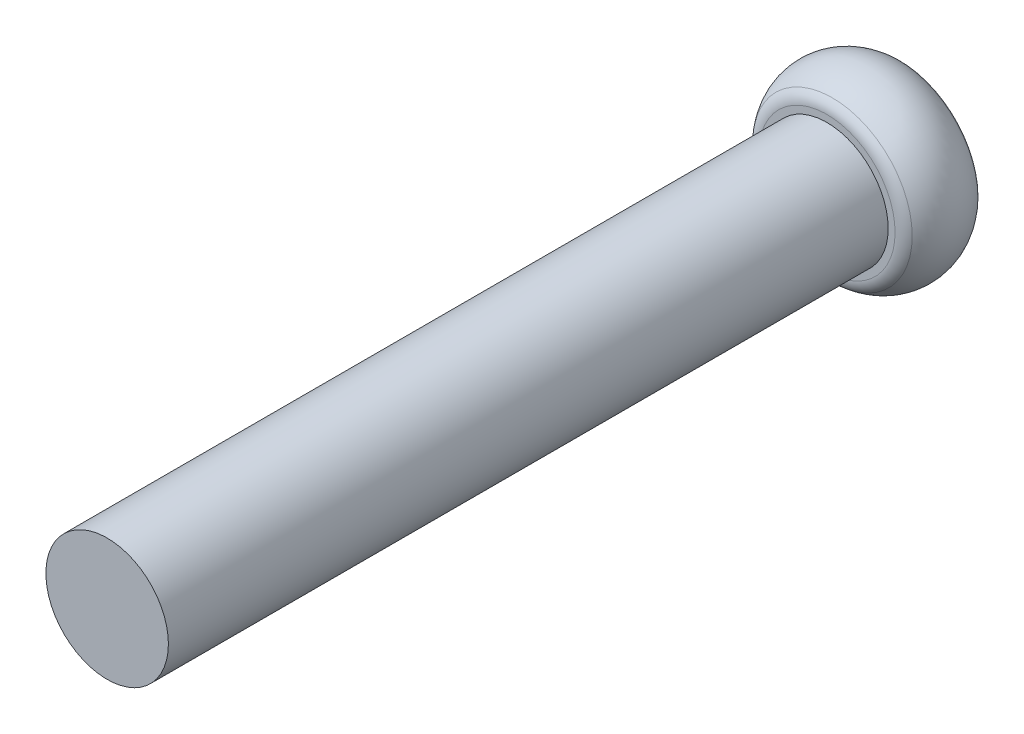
from build123d import *

# Parameters (mm, degrees)
CUT_EXTRUDE1_DEPTH = 1.5


with BuildPart() as part:
    # Sketch1 → Revolve1 (revolve)
    with BuildSketch(Plane(origin=(0, 0, 0), x_dir=(0, 0, -1), z_dir=(1, 0, 0)), mode=Mode.PRIVATE) as revolve1_sk:
        with BuildLine():
            Line((8.446859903, 2), (-15.053140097, 2))
            Line((-15.053140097, 2), (-15.053140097, 0))
            Line((-15.053140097, 0), (10.946859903, 0))
            Line((10.946859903, 0), (10.946859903, 2.225904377))
            ThreePointArc((10.946859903, 2.225904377), (10.900291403, 2.436617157), (10.769260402, 2.608079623))
            ThreePointArc((10.769260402, 2.608079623), (9.696859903, 3), (8.624459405, 2.608079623))
            ThreePointArc((8.624459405, 2.608079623), (8.493428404, 2.436617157), (8.446859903, 2.225904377))
            Line((8.446859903, 2.225904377), (8.446859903, 2))
        make_face()
    revolve(revolve1_sk.sketch.rotate(Axis((0, 0, 15.053140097), (0, 0, -1)), 90), axis=Axis((0, 0, 15.053140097), (0, 0, -1)))

    # Sketch2 → Cut-Extrude1 (cut)
    with BuildSketch(Plane(origin=(0, 0, -10.946859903), x_dir=(-1, 0, 0), z_dir=(0, 0, -1))):
        Polygon((0, 2), (1.414213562, 1.414213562), (2, 0), (1.414213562, -1.414213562), (0, -2), (-1.414213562, -1.414213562), (-2, 0), (-1.414213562, 1.414213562), align=None)
    extrude(amount=-CUT_EXTRUDE1_DEPTH, mode=Mode.SUBTRACT)


solid = part.part
